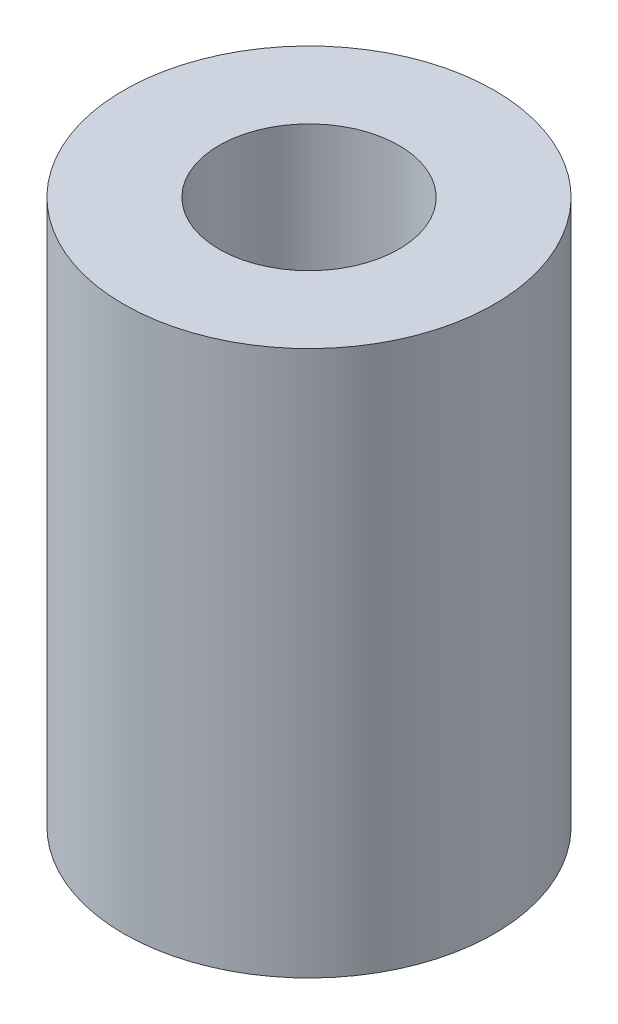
from build123d import *

# Parameters (mm, degrees)
ESQUISSE1_R        = 3.4
ESQUISSE1_R_2      = 1.65
BOSS_EXTRU_1_DEPTH = 10


with BuildPart() as part:
    # Esquisse1 → Boss.-Extru.1 (new body)
    with BuildSketch(Plane(origin=(0, 0, 0), x_dir=(1, 0, 0), z_dir=(0, 1, 0))):
        with Locations(Location((0, 0, 0), (0, 0, 270))):
            Circle(ESQUISSE1_R)
        with Locations(Location((0, 0, 0), (0, 0, 270))):
            Circle(ESQUISSE1_R_2, mode=Mode.SUBTRACT)
    extrude(amount=BOSS_EXTRU_1_DEPTH)


solid = part.part
